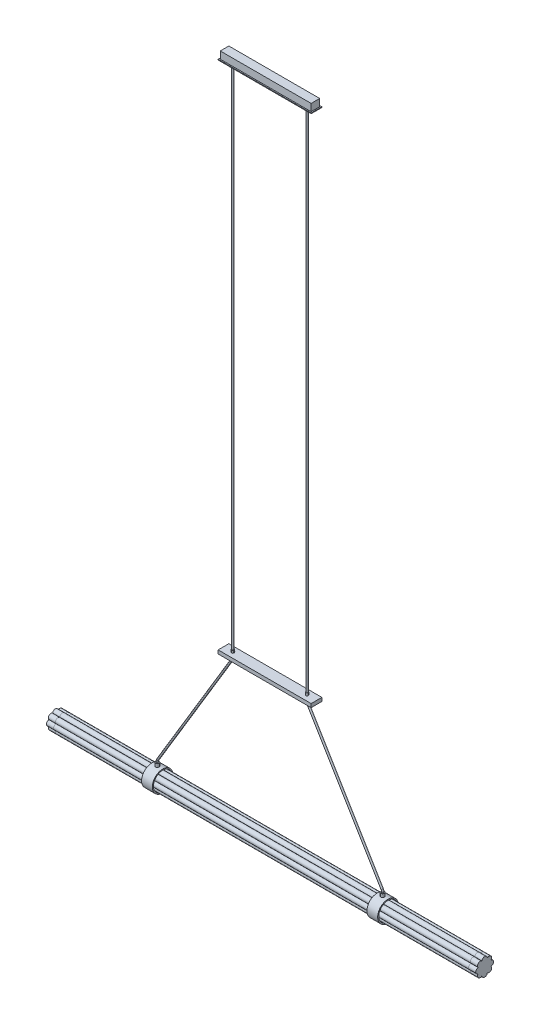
from build123d import *

# Parameters (mm, degrees)
SALIENTE_EXTRUIR1_DEPTH        = 580
SALIENTE_EXTRUIR1_DEPTH_BACK   = 580
SALIENTE_EXTRUIR2_DEPTH        = 580
SALIENTE_EXTRUIR2_DEPTH_BACK   = 580
CROQUIS3_R                     = 7.5
SALIENTE_EXTRUIR3_DEPTH        = 20
CROQUIS5_R                     = 29
CROQUIS5_R_2                   = 26
SALIENTE_EXTRUIR4_DEPTH        = 30
CROQUIS6_W                     = 260
CROQUIS6_H                     = 30
CROQUIS6_R                     = 3.5
SALIENTE_EXTRUIR5_DEPTH        = 10
CROQUIS7_R                     = 5
SALIENTE_EXTRUIR6_DEPTH        = 10
SALIENTE_EXTRUIR7_DEPTH        = 7
SALIENTE_EXTRUIR7_DEPTH_BACK   = 10
CROQUIS8_R                     = 3.5
CROQUIS8_R_2                   = 2.5
SALIENTE_EXTRUIR7_2_DEPTH      = 7
SALIENTE_EXTRUIR7_2_DEPTH_BACK = 10
CORTAR_EXTRUIR5_DEPTH          = 105
CORTAR_EXTRUIR5_DEPTH_BACK     = 105
CROQUIS10_R                    = 1.5
CROQUIS11_R                    = 1.5
SALIENTE_EXTRUIR8_DEPTH        = 2
CHAFL_N1_SIZE                  = 1
VACIADO1_T                     = -1
BARRER3_PROFILE_R              = 2.5
CROQUIS15_W                    = 260
CROQUIS15_H                    = 30
SALIENTE_EXTRUIR9_DEPTH        = 2
CROQUIS16_W                    = 254
CROQUIS16_H                    = 24
SALIENTE_EXTRUIR10_DEPTH       = 20


with BuildPart() as part:
    # Croquis2 → Saliente-Extruir1 (new, two sides: drawn at the far end of the back side and taken through both)
    with BuildSketch(Plane(origin=(0, 0, 0), x_dir=(0, 0, -1), z_dir=(1, 0, 0)).offset(-SALIENTE_EXTRUIR1_DEPTH_BACK)):
        with BuildLine():
            ThreePointArc((7.47931345, -18.056659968), (0, -10), (-7.47931345, -18.056659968))
            ThreePointArc((-7.47931345, -18.056659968), (-17.67766953, -17.67766953), (-18.056659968, -7.47931345))
            ThreePointArc((-18.056659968, -7.47931345), (-25, 0), (-18.056659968, 7.47931345))
            ThreePointArc((-18.056659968, 7.47931345), (-17.67766953, 17.67766953), (-7.47931345, 18.056659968))
            ThreePointArc((-7.47931345, 18.056659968), (0, 25), (7.47931345, 18.056659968))
            ThreePointArc((7.47931345, 18.056659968), (17.67766953, 17.67766953), (18.056659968, 7.47931345))
            ThreePointArc((18.056659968, 7.47931345), (25, 0), (18.056659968, -7.47931345))
            ThreePointArc((18.056659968, -7.47931345), (17.67766953, -17.67766953), (7.47931345, -18.056659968))
        make_face()
    extrude(amount=SALIENTE_EXTRUIR1_DEPTH + SALIENTE_EXTRUIR1_DEPTH_BACK)


with BuildPart() as body_2:
    # Croquis3 → Saliente-Extruir2 (new, two sides: drawn at the far end of the back side and taken through both)
    with BuildSketch(Plane(origin=(0, 0, 0), x_dir=(0, 0, -1), z_dir=(1, 0, 0)).offset(-SALIENTE_EXTRUIR2_DEPTH_BACK)):
        with Locations((0, -17.5)):
            Circle(CROQUIS3_R)
    extrude(amount=SALIENTE_EXTRUIR2_DEPTH + SALIENTE_EXTRUIR2_DEPTH_BACK)


with BuildPart() as body_3:
    # Croquis4 → Saliente-Extruir3 (new body)
    with BuildSketch(Plane.ZY.offset(580)):
        with BuildLine():
            ThreePointArc((-7.47931345, -18.056659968), (0, -25), (7.47931345, -18.056659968))
            ThreePointArc((7.47931345, -18.056659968), (17.67766953, -17.67766953), (18.056659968, -7.47931345))
            ThreePointArc((18.056659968, -7.47931345), (25, 0), (18.056659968, 7.47931345))
            ThreePointArc((18.056659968, 7.47931345), (17.67766953, 17.67766953), (7.47931345, 18.056659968))
            ThreePointArc((7.47931345, 18.056659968), (0, 25), (-7.47931345, 18.056659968))
            ThreePointArc((-7.47931345, 18.056659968), (-17.67766953, 17.67766953), (-18.056659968, 7.47931345))
            ThreePointArc((-18.056659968, 7.47931345), (-25, 0), (-18.056659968, -7.47931345))
            ThreePointArc((-18.056659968, -7.47931345), (-17.67766953, -17.67766953), (-7.47931345, -18.056659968))
        make_face()
    extrude(amount=SALIENTE_EXTRUIR3_DEPTH)


with BuildPart() as body_4:
    # Simetr_a2: mirrored copy
    add(body_3.part.mirror(Plane(origin=(0, 0, 0), x_dir=(0, 0, 1), z_dir=(1, 0, 0))))


with BuildPart() as body_5:
    # Croquis5 → Saliente-Extruir4 (new body)
    with BuildSketch(Plane(origin=(300, 0, 0), x_dir=(0, 0, -1), z_dir=(1, 0, 0))):
        Circle(CROQUIS5_R)
        Circle(CROQUIS5_R_2, mode=Mode.SUBTRACT)
    extrude(amount=SALIENTE_EXTRUIR4_DEPTH)


with BuildPart() as body_6:
    # Simetr_a3: mirrored copy
    add(body_5.part.mirror(Plane(origin=(0, 0, 0), x_dir=(0, 0, 1), z_dir=(1, 0, 0))))


with BuildPart() as body_7:
    # Croquis6 → Saliente-Extruir5 (new body)
    with BuildSketch(Plane(origin=(0, 400, 0), x_dir=(1, 0, 0), z_dir=(0, 1, 0))):
        Rectangle(CROQUIS6_W, CROQUIS6_H)
        with Locations(Location((103.5, 0, 0), (0, 0, 270))):
            Circle(CROQUIS6_R, mode=Mode.SUBTRACT)
        with Locations(Location((-103.5, 0, 0), (0, 0, 270))):
            Circle(CROQUIS6_R, mode=Mode.SUBTRACT)
    extrude(amount=SALIENTE_EXTRUIR5_DEPTH)


with BuildPart() as body_5_1:
    add(body_5.part)

    add(body_6.part)  # Saliente-Extruir6 merges body 6
    # Croquis7 → Saliente-Extruir6 (add)
    with BuildSketch(Plane(origin=(0, 28, 0), x_dir=(1, 0, 0), z_dir=(0, 1, 0))):
        with Locations(Location((315, 0, 0), (0, 0, 90))):
            Circle(CROQUIS7_R)
        with Locations(Location((-315, 0, 0), (0, 0, 90))):
            Circle(CROQUIS7_R)
    extrude(amount=SALIENTE_EXTRUIR6_DEPTH)


with BuildPart() as body_7_2:
    # Croquis8 → Saliente-Extruir7 (new, two sides: drawn at the far end of the back side and taken through both)
    with BuildSketch(Plane(origin=(0, 410, 0), x_dir=(1, 0, 0), z_dir=(0, 1, 0)).offset(-SALIENTE_EXTRUIR7_DEPTH_BACK)):
        with Locations(Location((103.5, 0, 0), (0, 0, 270))):
            Circle(CROQUIS8_R)
        with Locations(Location((103.5, 0, 0), (0, 0, 270))):
            Circle(CROQUIS8_R_2, mode=Mode.SUBTRACT)
    extrude(amount=SALIENTE_EXTRUIR7_DEPTH + SALIENTE_EXTRUIR7_DEPTH_BACK)


with BuildPart() as body_8:
    # Croquis8 → Saliente-Extruir7 2 (new, two sides: drawn at the far end of the back side and taken through both)
    with BuildSketch(Plane(origin=(0, 410, 0), x_dir=(1, 0, 0), z_dir=(0, 1, 0)).offset(-SALIENTE_EXTRUIR7_2_DEPTH_BACK)):
        with Locations(Location((-103.5, 0, 0), (0, 0, 270))):
            Circle(CROQUIS8_R)
        with Locations(Location((-103.5, 0, 0), (0, 0, 270))):
            Circle(CROQUIS8_R_2, mode=Mode.SUBTRACT)
    extrude(amount=SALIENTE_EXTRUIR7_2_DEPTH + SALIENTE_EXTRUIR7_2_DEPTH_BACK)


with BuildPart() as cortar_extruir5_tool:
    # Croquis10 → Cortar-Extruir5 (new, two sides: drawn at the far end of the back side and taken through both)
    with BuildSketch(Plane(origin=(0, 0, 0), x_dir=(0, 0, -1), z_dir=(1, 0, 0)).offset(-CORTAR_EXTRUIR5_DEPTH_BACK)):
        with Locations(Location((0, 412.5, 0), (0, 0, 180))):
            Circle(CROQUIS10_R)
    extrude(amount=CORTAR_EXTRUIR5_DEPTH + CORTAR_EXTRUIR5_DEPTH_BACK)


with BuildPart() as body_7_2_1:
    add(body_7_2.part)

    # Cortar-Extruir5: cut by cortar_extruir5_tool
    add(cortar_extruir5_tool.part, mode=Mode.SUBTRACT)


with BuildPart() as body_8_1:
    add(body_8.part)

    # Cortar-Extruir5: cut by cortar_extruir5_tool
    add(cortar_extruir5_tool.part, mode=Mode.SUBTRACT)


with BuildPart() as body_9:
    # Croquis11 → Saliente-Extruir8 (new body)
    with BuildSketch(Plane(origin=(100, 0, 0), x_dir=(0, 0, -1), z_dir=(1, 0, 0))):
        with Locations((0, 412.5)):
            Circle(CROQUIS11_R)
    extrude(amount=SALIENTE_EXTRUIR8_DEPTH)

    # Chafl_n1
    chafl_n1_edges = [body_9.edges().sort_by_distance(p)[0] for p in [
        (102, 412.5, 1.5),
    ]]
    chamfer(chafl_n1_edges, length=CHAFL_N1_SIZE)

    # Vaciado1
    vaciado1_openings = [body_9.faces().sort_by_distance(p)[0] for p in [
        (100, 412.5, 0),
    ]]
    offset(amount=VACIADO1_T, openings=vaciado1_openings, kind=Kind.INTERSECTION)


with BuildPart() as body_10:
    # Simetr_a5: mirrored copy
    add(body_9.part.mirror(Plane(origin=(0, 0, 0), x_dir=(0, 0, 1), z_dir=(1, 0, 0))))


with BuildPart() as body_11:
    # Barrer3: sweep along a path in Croquis12
    with BuildLine(Plane.XY) as barrer3_path:
        Line((-315, 38), (-315, 40.226787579))
        ThreePointArc((-315, 40.226787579), (-314.636312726, 42.899141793), (-313.571704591, 45.377115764))
        Line((-313.571704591, 45.377115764), (-104.928295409, 392.622884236))
        ThreePointArc((-104.928295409, 392.622884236), (-103.863687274, 395.100858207), (-103.5, 397.773212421))
        Line((-103.5, 397.773212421), (-103.5, 400))
        Line((-103.5, 400), (-103.5, 1838))
    # Barrer3 profile (on start of the path) → Barrer3 (sweep)
    with BuildSketch(Plane(origin=(-315, 38, 0), x_dir=(1, 0, 0), z_dir=(0, 1, 0))):
        Circle(BARRER3_PROFILE_R)
    sweep(path=barrer3_path.line)


with BuildPart() as body_12:
    # Simetr_a8: mirrored copy
    add(body_11.part.mirror(Plane(origin=(0, 0, 0), x_dir=(0, 0, 1), z_dir=(1, 0, 0))))


with BuildPart() as body_11_1:
    add(body_11.part)

    add(body_12.part)  # Saliente-Extruir9 merges body 12
    # Croquis15 → Saliente-Extruir9 (add)
    with BuildSketch(Plane(origin=(0, 1838, 0), x_dir=(1, 0, 0), z_dir=(0, 1, 0))):
        Rectangle(CROQUIS15_W, CROQUIS15_H)
    extrude(amount=SALIENTE_EXTRUIR9_DEPTH)

    # Croquis16 → Saliente-Extruir10 (add)
    with BuildSketch(Plane(origin=(0, 1840, 0), x_dir=(1, 0, 0), z_dir=(0, 1, 0))):
        Rectangle(CROQUIS16_W, CROQUIS16_H)
    extrude(amount=SALIENTE_EXTRUIR10_DEPTH)


solid = Compound([part.part, body_2.part, body_3.part, body_4.part, body_7.part, body_5_1.part, body_7_2_1.part, body_8_1.part, body_9.part, body_10.part, body_11_1.part])
